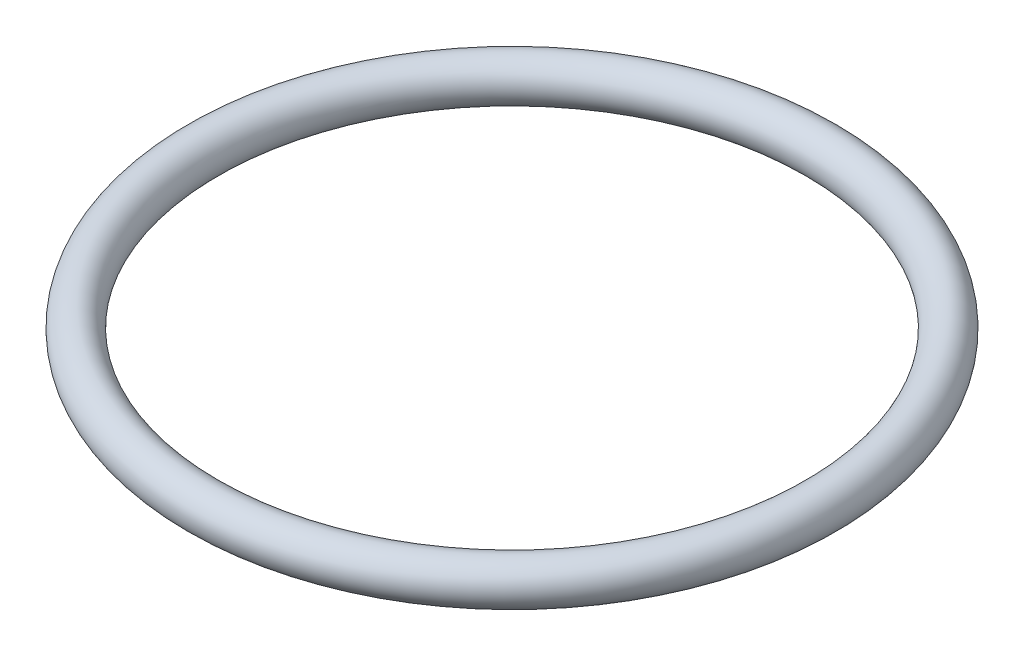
ISO-10303-21;
HEADER;
FILE_DESCRIPTION(('STEP AP214'),'2;1');
FILE_NAME('part.step','',(''),(''),'','','');
FILE_SCHEMA(('AUTOMOTIVE_DESIGN { 1 0 10303 214 1 1 1 1 }'));
ENDSEC;
DATA;
#1=APPLICATION_CONTEXT('core data for automotive mechanical design processes');
#2=APPLICATION_PROTOCOL_DEFINITION('international standard','automotive_design',2000,#1);
#3=PRODUCT_CONTEXT('',#1,'mechanical');
#4=PRODUCT('Part','Part','',(#3));
#5=PRODUCT_RELATED_PRODUCT_CATEGORY('part','',(#4));
#6=PRODUCT_DEFINITION_FORMATION('','',#4);
#7=PRODUCT_DEFINITION_CONTEXT('part definition',#1,'design');
#8=PRODUCT_DEFINITION('design','',#6,#7);
#9=PRODUCT_DEFINITION_SHAPE('','',#8);
#10=(LENGTH_UNIT() NAMED_UNIT(*) SI_UNIT(.MILLI.,.METRE.));
#11=(NAMED_UNIT(*) PLANE_ANGLE_UNIT() SI_UNIT($,.RADIAN.));
#12=(NAMED_UNIT(*) SI_UNIT($,.STERADIAN.) SOLID_ANGLE_UNIT());
#13=UNCERTAINTY_MEASURE_WITH_UNIT(LENGTH_MEASURE(1.E-05),#10,'distance_accuracy_value','');
#14=(GEOMETRIC_REPRESENTATION_CONTEXT(3) GLOBAL_UNCERTAINTY_ASSIGNED_CONTEXT((#13)) GLOBAL_UNIT_ASSIGNED_CONTEXT((#10,
#11,#12)) REPRESENTATION_CONTEXT('',''));
#15=CARTESIAN_POINT('',(0.,0.,0.));
#16=DIRECTION('',(0.,0.,1.));
#17=DIRECTION('',(1.,0.,0.));
#18=AXIS2_PLACEMENT_3D('',#15,#16,#17);
#19=CARTESIAN_POINT('',(0.,0.8382,0.));
#20=DIRECTION('',(0.,-1.,0.));
#21=DIRECTION('',(0.,0.,-1.));
#22=AXIS2_PLACEMENT_3D('',#19,#20,#21);
#23=TOROIDAL_SURFACE('',#22,12.2682,0.838200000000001);
#24=CARTESIAN_POINT('',(0.,0.8382,-13.1064));
#25=VERTEX_POINT('',#24);
#26=VERTEX_LOOP('',#25);
#27=FACE_BOUND('',#26,.T.);
#28=ADVANCED_FACE('F26',(#27),#23,.T.);
#29=CLOSED_SHELL('',(#28));
#30=MANIFOLD_SOLID_BREP('B2',#29);
#31=ADVANCED_BREP_SHAPE_REPRESENTATION('',(#18,#30),#14);
#32=SHAPE_DEFINITION_REPRESENTATION(#9,#31);
ENDSEC;
END-ISO-10303-21;
